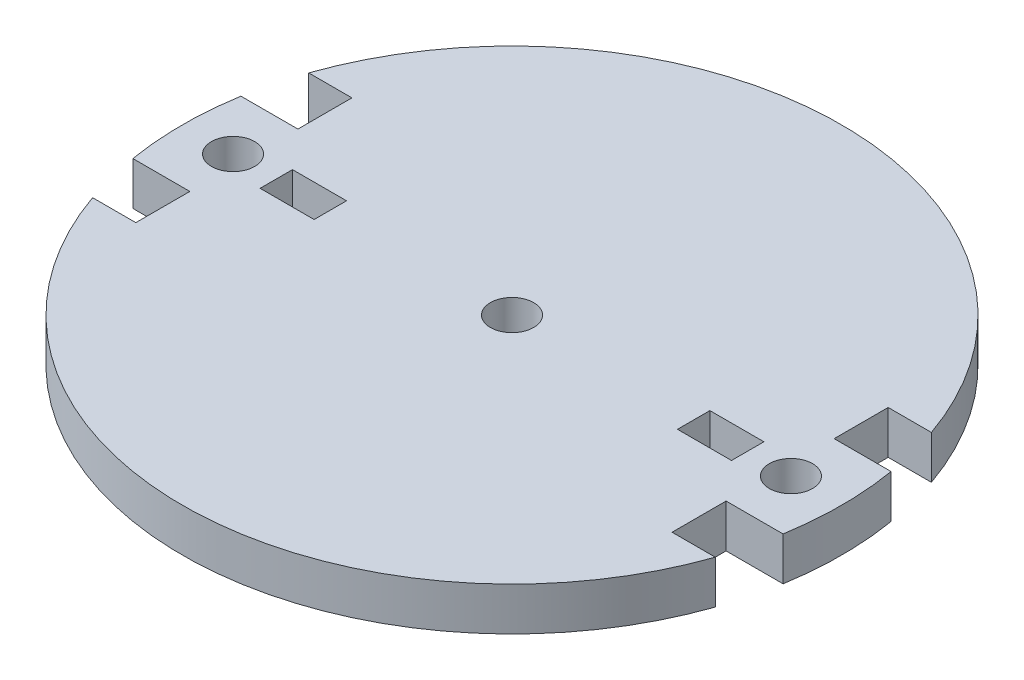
from build123d import *

# Parameters (mm, degrees)
CROQUIS1_R              = 30.5
SALIENTE_EXTRUIR1_DEPTH = 4
CROQUIS2_R              = 2
CORTAR_EXTRUIR1_DEPTH   = 4
CORTAR_EXTRUIR3_START   = -4
CORTAR_EXTRUIR3_DEPTH   = 4
CROQUIS6_W              = 5
CROQUIS6_H              = 3
CORTAR_EXTRUIR4_DEPTH   = 4
CROQUIS7_R              = 2
CORTAR_EXTRUIR5_DEPTH   = 4


with BuildPart() as part:
    # Croquis1 → Saliente-Extruir1 (new body)
    with BuildSketch(Plane(origin=(0, 0, 0), x_dir=(1, 0, 0), z_dir=(0, 1, 0))):
        with Locations(Location((0, 0, 0), (0, 0, 270))):
            Circle(CROQUIS1_R)
    extrude(amount=SALIENTE_EXTRUIR1_DEPTH)

    # Croquis2 → Cortar-Extruir1 (cut)
    with BuildSketch(Plane(origin=(0, 4, 0), x_dir=(1, 0, 0), z_dir=(0, 1, 0))):
        with Locations(Location((0, 0, 0), (0, 0, 270))):
            Circle(CROQUIS2_R)
    extrude(amount=-CORTAR_EXTRUIR1_DEPTH, mode=Mode.SUBTRACT)

    # Croquis5 → Cortar-Extruir3 (cut)
    with BuildSketch(Plane(origin=(0, 4, 0), x_dir=(1, 0, 0), z_dir=(0, 1, 0)).offset(CORTAR_EXTRUIR3_START)):
        with BuildLine():
            Line((28.814059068, 5), (30.087372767, 5))
            ThreePointArc((30.087372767, 5), (29.556634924, 7.526973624), (28.814059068, 10))
            Line((28.814059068, 10), (24.814059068, 10))
            Line((24.814059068, 10), (24.814059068, 5))
            Line((24.814059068, 5), (28.814059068, 5))
        make_face()
        with BuildLine():
            Line((30.087372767, -5), (28.814059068, -5))
            Line((28.814059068, -5), (24.814059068, -5))
            Line((24.814059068, -5), (24.814059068, -10))
            Line((24.814059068, -10), (28.814059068, -10))
            ThreePointArc((28.814059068, -10), (29.556634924, -7.526973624), (30.087372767, -5))
        make_face()
        with BuildLine():
            Line((-24.814059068, 5), (-24.814059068, 10))
            Line((-24.814059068, 10), (-28.814059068, 10))
            ThreePointArc((-28.814059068, 10), (-29.556634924, 7.526973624), (-30.087372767, 5))
            Line((-30.087372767, 5), (-28.814059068, 5))
            Line((-28.814059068, 5), (-24.814059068, 5))
        make_face()
        with BuildLine():
            Line((-28.814059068, -10), (-24.814059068, -10))
            Line((-24.814059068, -10), (-24.814059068, -5))
            Line((-24.814059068, -5), (-28.814059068, -5))
            Line((-28.814059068, -5), (-30.087372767, -5))
            ThreePointArc((-30.087372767, -5), (-29.556634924, -7.526973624), (-28.814059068, -10))
        make_face()
    extrude(amount=CORTAR_EXTRUIR3_DEPTH, mode=Mode.SUBTRACT)

    # Croquis6 → Cortar-Extruir4 (cut)
    with BuildSketch(Plane(origin=(0, 4, 0), x_dir=(1, 0, 0), z_dir=(0, 1, 0))):
        with Locations((19.314059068, 0)):
            Rectangle(CROQUIS6_W, CROQUIS6_H)
        with Locations((-19.314059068, 0)):
            Rectangle(CROQUIS6_W, CROQUIS6_H)
    extrude(amount=-CORTAR_EXTRUIR4_DEPTH, mode=Mode.SUBTRACT)

    # Croquis7 → Cortar-Extruir5 (cut)
    with BuildSketch(Plane(origin=(0, 4, 0), x_dir=(1, 0, 0), z_dir=(0, 1, 0))):
        with Locations(Location((-25.814059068, 0, 0), (0, 0, 270))):
            Circle(CROQUIS7_R)
        with Locations(Location((25.814059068, 0, 0), (0, 0, 90))):
            Circle(CROQUIS7_R)
    extrude(amount=-CORTAR_EXTRUIR5_DEPTH, mode=Mode.SUBTRACT)


solid = part.part
